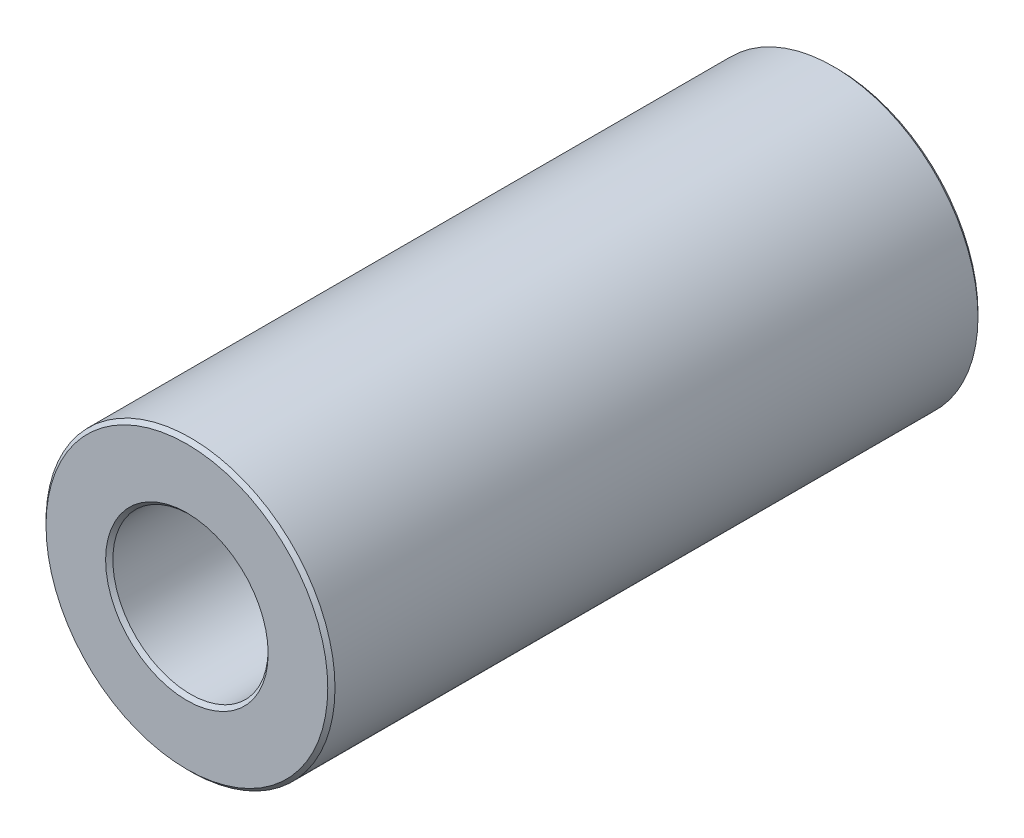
ISO-10303-21;
HEADER;
FILE_DESCRIPTION(('STEP AP214'),'2;1');
FILE_NAME('part.step','',(''),(''),'','','');
FILE_SCHEMA(('AUTOMOTIVE_DESIGN { 1 0 10303 214 1 1 1 1 }'));
ENDSEC;
DATA;
#1=APPLICATION_CONTEXT('core data for automotive mechanical design processes');
#2=APPLICATION_PROTOCOL_DEFINITION('international standard','automotive_design',2000,#1);
#3=PRODUCT_CONTEXT('',#1,'mechanical');
#4=PRODUCT('Part','Part','',(#3));
#5=PRODUCT_RELATED_PRODUCT_CATEGORY('part','',(#4));
#6=PRODUCT_DEFINITION_FORMATION('','',#4);
#7=PRODUCT_DEFINITION_CONTEXT('part definition',#1,'design');
#8=PRODUCT_DEFINITION('design','',#6,#7);
#9=PRODUCT_DEFINITION_SHAPE('','',#8);
#10=(LENGTH_UNIT() NAMED_UNIT(*) SI_UNIT(.MILLI.,.METRE.));
#11=(NAMED_UNIT(*) PLANE_ANGLE_UNIT() SI_UNIT($,.RADIAN.));
#12=(NAMED_UNIT(*) SI_UNIT($,.STERADIAN.) SOLID_ANGLE_UNIT());
#13=UNCERTAINTY_MEASURE_WITH_UNIT(LENGTH_MEASURE(1.E-05),#10,'distance_accuracy_value','');
#14=(GEOMETRIC_REPRESENTATION_CONTEXT(3) GLOBAL_UNCERTAINTY_ASSIGNED_CONTEXT((#13)) GLOBAL_UNIT_ASSIGNED_CONTEXT((#10,
#11,#12)) REPRESENTATION_CONTEXT('',''));
#15=CARTESIAN_POINT('',(0.,0.,0.));
#16=DIRECTION('',(0.,0.,1.));
#17=DIRECTION('',(1.,0.,0.));
#18=AXIS2_PLACEMENT_3D('',#15,#16,#17);
#19=CARTESIAN_POINT('',(0.,0.,9.));
#20=DIRECTION('',(0.,0.,1.));
#21=DIRECTION('',(1.,0.,0.));
#22=AXIS2_PLACEMENT_3D('',#19,#20,#21);
#23=PLANE('',#22);
#24=CARTESIAN_POINT('',(0.,0.,9.));
#25=DIRECTION('',(0.,0.,1.));
#26=DIRECTION('',(1.,0.,0.));
#27=AXIS2_PLACEMENT_3D('',#24,#25,#26);
#28=CIRCLE('',#27,2.25);
#29=CARTESIAN_POINT('',(2.25,0.,9.));
#30=VERTEX_POINT('',#29);
#31=EDGE_CURVE('E10',#30,#30,#28,.F.);
#32=ORIENTED_EDGE('',*,*,#31,.T.);
#33=EDGE_LOOP('',(#32));
#34=FACE_BOUND('',#33,.T.);
#35=CARTESIAN_POINT('',(0.,0.,9.));
#36=DIRECTION('',(0.,0.,1.));
#37=DIRECTION('',(1.,0.,0.));
#38=AXIS2_PLACEMENT_3D('',#35,#36,#37);
#39=CIRCLE('',#38,3.9);
#40=CARTESIAN_POINT('',(3.9,0.,9.));
#41=VERTEX_POINT('',#40);
#42=EDGE_CURVE('E45',#41,#41,#39,.T.);
#43=ORIENTED_EDGE('',*,*,#42,.T.);
#44=EDGE_LOOP('',(#43));
#45=FACE_BOUND('',#44,.T.);
#46=ADVANCED_FACE('F37',(#34,#45),#23,.T.);
#47=CARTESIAN_POINT('',(0.,0.,-9.));
#48=DIRECTION('',(0.,0.,1.));
#49=DIRECTION('',(1.,0.,0.));
#50=AXIS2_PLACEMENT_3D('',#47,#48,#49);
#51=PLANE('',#50);
#52=CARTESIAN_POINT('',(0.,0.,-9.));
#53=DIRECTION('',(0.,0.,1.));
#54=DIRECTION('',(1.,0.,0.));
#55=AXIS2_PLACEMENT_3D('',#52,#53,#54);
#56=CIRCLE('',#55,3.9);
#57=CARTESIAN_POINT('',(3.9,0.,-9.));
#58=VERTEX_POINT('',#57);
#59=EDGE_CURVE('E64',#58,#58,#56,.F.);
#60=ORIENTED_EDGE('',*,*,#59,.T.);
#61=EDGE_LOOP('',(#60));
#62=FACE_BOUND('',#61,.T.);
#63=CARTESIAN_POINT('',(0.,0.,-9.));
#64=DIRECTION('',(0.,0.,1.));
#65=DIRECTION('',(1.,0.,0.));
#66=AXIS2_PLACEMENT_3D('',#63,#64,#65);
#67=CIRCLE('',#66,2.25);
#68=CARTESIAN_POINT('',(2.25,0.,-9.));
#69=VERTEX_POINT('',#68);
#70=EDGE_CURVE('E67',#69,#69,#67,.T.);
#71=ORIENTED_EDGE('',*,*,#70,.T.);
#72=EDGE_LOOP('',(#71));
#73=FACE_BOUND('',#72,.T.);
#74=ADVANCED_FACE('F89',(#62,#73),#51,.F.);
#75=CARTESIAN_POINT('',(0.,0.,9.));
#76=DIRECTION('',(0.,0.,-1.));
#77=DIRECTION('',(-1.,0.,0.));
#78=AXIS2_PLACEMENT_3D('',#75,#76,#77);
#79=CYLINDRICAL_SURFACE('',#78,4.);
#80=CARTESIAN_POINT('',(0.,0.,-8.9));
#81=DIRECTION('',(0.,0.,1.));
#82=DIRECTION('',(1.,0.,0.));
#83=AXIS2_PLACEMENT_3D('',#80,#81,#82);
#84=CIRCLE('',#83,4.);
#85=CARTESIAN_POINT('',(4.,0.,-8.9));
#86=VERTEX_POINT('',#85);
#87=EDGE_CURVE('E71',#86,#86,#84,.T.);
#88=ORIENTED_EDGE('',*,*,#87,.T.);
#89=EDGE_LOOP('',(#88));
#90=FACE_BOUND('',#89,.T.);
#91=CARTESIAN_POINT('',(0.,0.,8.9));
#92=DIRECTION('',(0.,0.,1.));
#93=DIRECTION('',(1.,0.,0.));
#94=AXIS2_PLACEMENT_3D('',#91,#92,#93);
#95=CIRCLE('',#94,4.);
#96=CARTESIAN_POINT('',(4.,0.,8.9));
#97=VERTEX_POINT('',#96);
#98=EDGE_CURVE('E74',#97,#97,#95,.F.);
#99=ORIENTED_EDGE('',*,*,#98,.T.);
#100=EDGE_LOOP('',(#99));
#101=FACE_BOUND('',#100,.T.);
#102=ADVANCED_FACE('F78',(#90,#101),#79,.T.);
#103=CARTESIAN_POINT('',(0.,0.,9.));
#104=DIRECTION('',(0.,0.,-1.));
#105=DIRECTION('',(-1.,0.,0.));
#106=AXIS2_PLACEMENT_3D('',#103,#104,#105);
#107=CYLINDRICAL_SURFACE('',#106,2.15);
#108=CARTESIAN_POINT('',(0.,0.,-8.9));
#109=DIRECTION('',(0.,0.,1.));
#110=DIRECTION('',(1.,0.,0.));
#111=AXIS2_PLACEMENT_3D('',#108,#109,#110);
#112=CIRCLE('',#111,2.15);
#113=CARTESIAN_POINT('',(2.15,0.,-8.9));
#114=VERTEX_POINT('',#113);
#115=EDGE_CURVE('E52',#114,#114,#112,.F.);
#116=ORIENTED_EDGE('',*,*,#115,.T.);
#117=EDGE_LOOP('',(#116));
#118=FACE_BOUND('',#117,.T.);
#119=CARTESIAN_POINT('',(0.,0.,8.9));
#120=DIRECTION('',(0.,0.,1.));
#121=DIRECTION('',(1.,0.,0.));
#122=AXIS2_PLACEMENT_3D('',#119,#120,#121);
#123=CIRCLE('',#122,2.15);
#124=CARTESIAN_POINT('',(2.15,0.,8.9));
#125=VERTEX_POINT('',#124);
#126=EDGE_CURVE('E58',#125,#125,#123,.T.);
#127=ORIENTED_EDGE('',*,*,#126,.T.);
#128=EDGE_LOOP('',(#127));
#129=FACE_BOUND('',#128,.T.);
#130=ADVANCED_FACE('F97',(#118,#129),#107,.F.);
#131=CARTESIAN_POINT('',(0.,0.,-8.9));
#132=DIRECTION('',(0.,0.,1.));
#133=DIRECTION('',(1.,0.,0.));
#134=AXIS2_PLACEMENT_3D('',#131,#132,#133);
#135=CONICAL_SURFACE('',#134,4.,0.78539816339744);
#136=ORIENTED_EDGE('',*,*,#59,.F.);
#137=EDGE_LOOP('',(#136));
#138=FACE_BOUND('',#137,.T.);
#139=ORIENTED_EDGE('',*,*,#87,.F.);
#140=EDGE_LOOP('',(#139));
#141=FACE_BOUND('',#140,.T.);
#142=ADVANCED_FACE('F102',(#138,#141),#135,.T.);
#143=CARTESIAN_POINT('',(0.,0.,-9.));
#144=DIRECTION('',(0.,0.,-1.));
#145=DIRECTION('',(-1.,0.,0.));
#146=AXIS2_PLACEMENT_3D('',#143,#144,#145);
#147=CONICAL_SURFACE('',#146,2.25,0.785398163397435);
#148=ORIENTED_EDGE('',*,*,#115,.F.);
#149=EDGE_LOOP('',(#148));
#150=FACE_BOUND('',#149,.T.);
#151=ORIENTED_EDGE('',*,*,#70,.F.);
#152=EDGE_LOOP('',(#151));
#153=FACE_BOUND('',#152,.T.);
#154=ADVANCED_FACE('F86',(#150,#153),#147,.F.);
#155=CARTESIAN_POINT('',(0.,0.,8.9));
#156=DIRECTION('',(0.,0.,1.));
#157=DIRECTION('',(1.,0.,0.));
#158=AXIS2_PLACEMENT_3D('',#155,#156,#157);
#159=CONICAL_SURFACE('',#158,2.15,0.785398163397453);
#160=ORIENTED_EDGE('',*,*,#31,.F.);
#161=EDGE_LOOP('',(#160));
#162=FACE_BOUND('',#161,.T.);
#163=ORIENTED_EDGE('',*,*,#126,.F.);
#164=EDGE_LOOP('',(#163));
#165=FACE_BOUND('',#164,.T.);
#166=ADVANCED_FACE('F82',(#162,#165),#159,.F.);
#167=CARTESIAN_POINT('',(0.,0.,9.));
#168=DIRECTION('',(0.,0.,-1.));
#169=DIRECTION('',(-1.,0.,0.));
#170=AXIS2_PLACEMENT_3D('',#167,#168,#169);
#171=CONICAL_SURFACE('',#170,3.9,0.785398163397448);
#172=ORIENTED_EDGE('',*,*,#98,.F.);
#173=EDGE_LOOP('',(#172));
#174=FACE_BOUND('',#173,.T.);
#175=ORIENTED_EDGE('',*,*,#42,.F.);
#176=EDGE_LOOP('',(#175));
#177=FACE_BOUND('',#176,.T.);
#178=ADVANCED_FACE('F39',(#174,#177),#171,.T.);
#179=CLOSED_SHELL('',(#46,#74,#102,#130,#142,#154,#166,#178));
#180=MANIFOLD_SOLID_BREP('B2',#179);
#181=ADVANCED_BREP_SHAPE_REPRESENTATION('',(#18,#180),#14);
#182=SHAPE_DEFINITION_REPRESENTATION(#9,#181);
ENDSEC;
END-ISO-10303-21;
